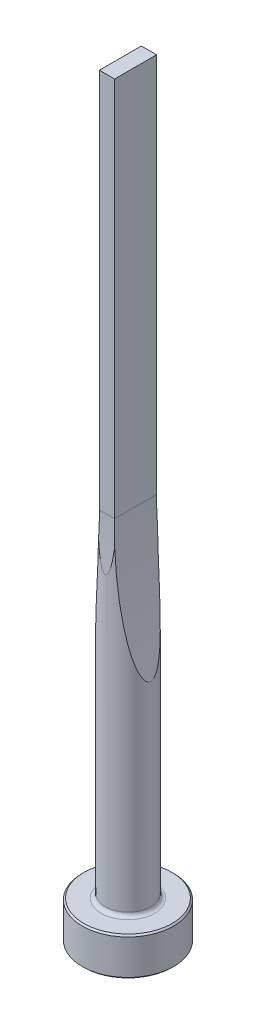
from build123d import *

# Parameters (mm, degrees)
CUT_EXTRUDE1_DEPTH = 5
CUT_EXTRUDE2_DEPTH = 5


with BuildPart() as part:
    # Sketch1 → Revolve1 (revolve)
    with BuildSketch(Plane.XY, mode=Mode.PRIVATE) as revolve1_sk:
        with BuildLine():
            Line((0, 0), (5.8, 0))
            Line((5.8, 0), (6, 0.2))
            Line((6, 0.2), (6, 4.8))
            Line((6, 4.8), (5.8, 5))
            Line((5.8, 5), (3.5, 5))
            ThreePointArc((3.5, 5), (3.146446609, 5.146446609), (3, 5.5))
            Line((3, 5.5), (3, 100))
            Line((3, 100), (0, 100))
            Line((0, 100), (0, 0))
        make_face()
    revolve(revolve1_sk.sketch.rotate(Axis((0, 100, 0), (0, -1, 0)), 180), axis=Axis((0, 100, 0), (0, -1, 0)))

    # Sketch2 → Cut-Extrude1 (cut, symmetric)
    with BuildSketch(Plane.XY):
        with BuildLine():
            Line((1, 100), (1, 50))
            ThreePointArc((1, 50), (1.501396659, 40.513167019), (3, 31.132037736))
            Line((3, 31.132037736), (3, 100))
            Line((3, 100), (1, 100))
        make_face()
        with BuildLine():
            Line((-1, 100), (-1, 50))
            ThreePointArc((-1, 50), (-1.501396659, 40.513167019), (-3, 31.132037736))
            Line((-3, 31.132037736), (-3, 100))
            Line((-3, 100), (-1, 100))
        make_face()
    extrude(amount=CUT_EXTRUDE1_DEPTH, both=True, mode=Mode.SUBTRACT)

    # Sketch3 → Cut-Extrude2 (cut, symmetric)
    with BuildSketch(Plane(origin=(0, 0, 0), x_dir=(0, 0, -1), z_dir=(1, 0, 0))):
        with BuildLine():
            Line((2.75, 100), (2.75, 50))
            ThreePointArc((2.75, 50), (2.812521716, 46.645898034), (3, 43.296456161))
            Line((3, 43.296456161), (3, 100))
            Line((3, 100), (2.75, 100))
        make_face()
        with BuildLine():
            Line((-2.75, 100), (-2.75, 50))
            ThreePointArc((-2.75, 50), (-2.812521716, 46.645898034), (-3, 43.296456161))
            Line((-3, 43.296456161), (-3, 100))
            Line((-3, 100), (-2.75, 100))
        make_face()
    extrude(amount=CUT_EXTRUDE2_DEPTH, both=True, mode=Mode.SUBTRACT)


solid = part.part
